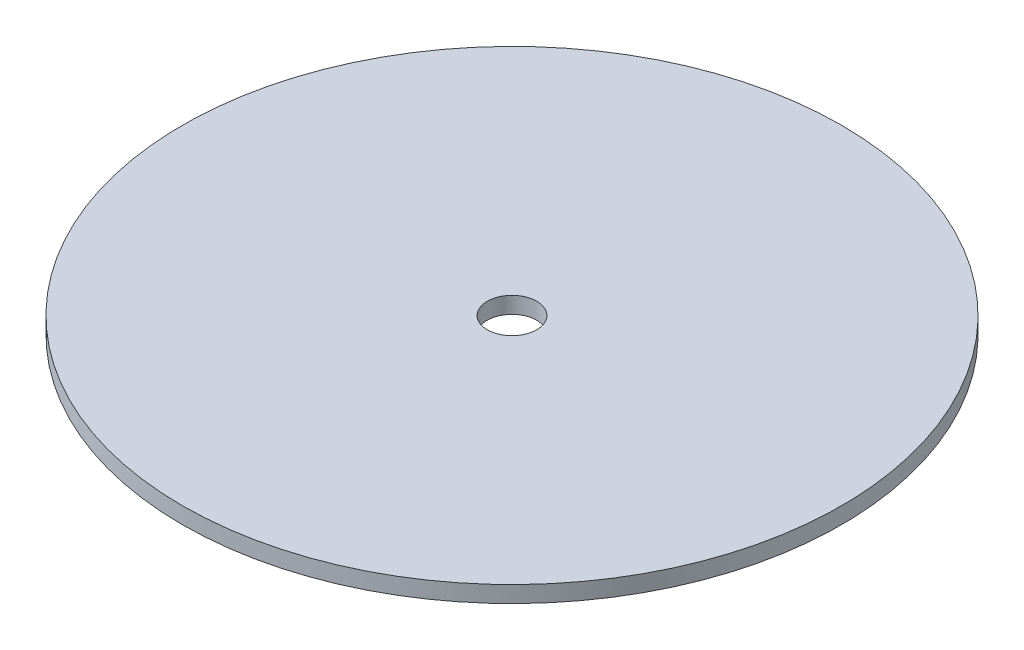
from build123d import *

# Parameters (mm, degrees)
SZKIC1_R                    = 400
SZKIC1_R_2                  = 30
DODANIE_WYCI_GNI_CIE1_DEPTH = 20


with BuildPart() as part:
    # Szkic1 → Dodanie-wyci_gni_cie1 (new body)
    with BuildSketch(Plane(origin=(0, 0, 0), x_dir=(1, 0, 0), z_dir=(0, 1, 0))):
        with Locations(Location((0, 0, 0), (0, 0, 270))):
            Circle(SZKIC1_R)
        with Locations(Location((0, 0, 0), (0, 0, 270))):
            Circle(SZKIC1_R_2, mode=Mode.SUBTRACT)
    extrude(amount=DODANIE_WYCI_GNI_CIE1_DEPTH)


solid = part.part
